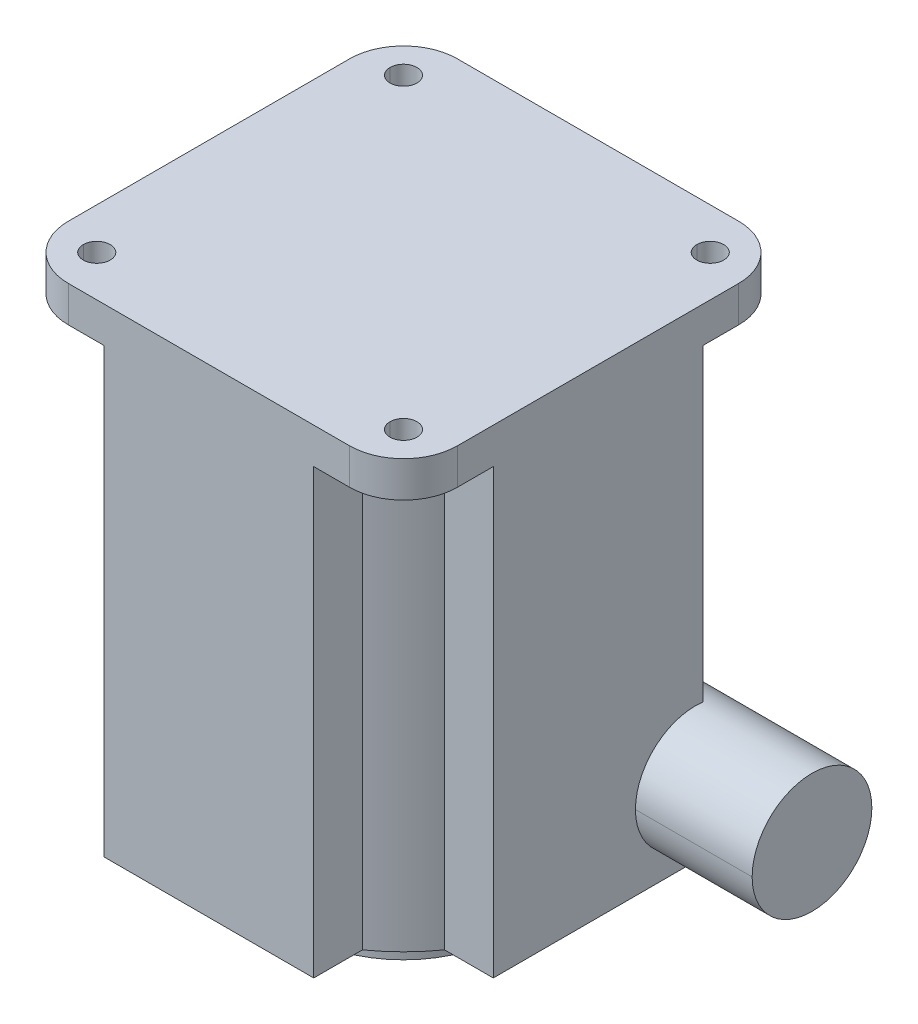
ISO-10303-21;
HEADER;
FILE_DESCRIPTION(('STEP AP214'),'2;1');
FILE_NAME('part.step','',(''),(''),'','','');
FILE_SCHEMA(('AUTOMOTIVE_DESIGN { 1 0 10303 214 1 1 1 1 }'));
ENDSEC;
DATA;
#1=APPLICATION_CONTEXT('core data for automotive mechanical design processes');
#2=APPLICATION_PROTOCOL_DEFINITION('international standard','automotive_design',2000,#1);
#3=PRODUCT_CONTEXT('',#1,'mechanical');
#4=PRODUCT('Part','Part','',(#3));
#5=PRODUCT_RELATED_PRODUCT_CATEGORY('part','',(#4));
#6=PRODUCT_DEFINITION_FORMATION('','',#4);
#7=PRODUCT_DEFINITION_CONTEXT('part definition',#1,'design');
#8=PRODUCT_DEFINITION('design','',#6,#7);
#9=PRODUCT_DEFINITION_SHAPE('','',#8);
#10=(LENGTH_UNIT() NAMED_UNIT(*) SI_UNIT(.MILLI.,.METRE.));
#11=(NAMED_UNIT(*) PLANE_ANGLE_UNIT() SI_UNIT($,.RADIAN.));
#12=(NAMED_UNIT(*) SI_UNIT($,.STERADIAN.) SOLID_ANGLE_UNIT());
#13=UNCERTAINTY_MEASURE_WITH_UNIT(LENGTH_MEASURE(1.E-05),#10,'distance_accuracy_value','');
#14=(GEOMETRIC_REPRESENTATION_CONTEXT(3) GLOBAL_UNCERTAINTY_ASSIGNED_CONTEXT((#13)) GLOBAL_UNIT_ASSIGNED_CONTEXT((#10,
#11,#12)) REPRESENTATION_CONTEXT('',''));
#15=CARTESIAN_POINT('',(0.,0.,0.));
#16=DIRECTION('',(0.,0.,1.));
#17=DIRECTION('',(1.,0.,0.));
#18=AXIS2_PLACEMENT_3D('',#15,#16,#17);
#19=CARTESIAN_POINT('',(110.,320.,1625.));
#20=DIRECTION('',(0.,-1.,0.));
#21=DIRECTION('',(1.,0.,0.));
#22=AXIS2_PLACEMENT_3D('',#19,#20,#21);
#23=PLANE('',#22);
#24=CARTESIAN_POINT('',(110.,320.,1625.));
#25=DIRECTION('',(0.,-1.,0.));
#26=DIRECTION('',(1.,0.,0.));
#27=AXIS2_PLACEMENT_3D('',#24,#25,#26);
#28=CIRCLE('',#27,35.);
#29=CARTESIAN_POINT('',(145.,320.,1625.));
#30=VERTEX_POINT('',#29);
#31=CARTESIAN_POINT('',(75.,320.,1625.));
#32=VERTEX_POINT('',#31);
#33=EDGE_CURVE('E21',#30,#32,#28,.T.);
#34=ORIENTED_EDGE('',*,*,#33,.T.);
#35=EDGE_CURVE('E269',#32,#30,#28,.T.);
#36=ORIENTED_EDGE('',*,*,#35,.T.);
#37=EDGE_LOOP('',(#34,#36));
#38=FACE_BOUND('',#37,.T.);
#39=ADVANCED_FACE('F17',(#38),#23,.T.);
#40=CARTESIAN_POINT('',(214.,500.,1625.));
#41=DIRECTION('',(1.,0.,0.));
#42=DIRECTION('',(0.,0.,1.));
#43=AXIS2_PLACEMENT_3D('',#40,#41,#42);
#44=PLANE('',#43);
#45=CARTESIAN_POINT('',(214.,365.,1592.5));
#46=DIRECTION('',(1.,0.,0.));
#47=DIRECTION('',(0.,1.,0.));
#48=AXIS2_PLACEMENT_3D('',#45,#46,#47);
#49=CIRCLE('',#48,20.);
#50=CARTESIAN_POINT('',(214.,365.,1612.5));
#51=VERTEX_POINT('',#50);
#52=CARTESIAN_POINT('',(214.,365.,1572.5));
#53=VERTEX_POINT('',#52);
#54=EDGE_CURVE('E286',#51,#53,#49,.T.);
#55=ORIENTED_EDGE('',*,*,#54,.T.);
#56=EDGE_CURVE('E281',#53,#51,#49,.T.);
#57=ORIENTED_EDGE('',*,*,#56,.T.);
#58=EDGE_LOOP('',(#55,#57));
#59=FACE_BOUND('',#58,.T.);
#60=ADVANCED_FACE('F1448',(#59),#44,.T.);
#61=CARTESIAN_POINT('',(110.,330.,1625.));
#62=DIRECTION('',(0.,-1.,0.));
#63=DIRECTION('',(1.,0.,0.));
#64=AXIS2_PLACEMENT_3D('',#61,#62,#63);
#65=CYLINDRICAL_SURFACE('',#64,35.);
#66=DIRECTION('',(0.,-1.,0.));
#67=VECTOR('',#66,1.);
#68=CARTESIAN_POINT('',(75.,330.,1625.));
#69=LINE('',#68,#67);
#70=CARTESIAN_POINT('',(75.,340.,1625.));
#71=VERTEX_POINT('',#70);
#72=EDGE_CURVE('E272',#32,#71,#69,.F.);
#73=ORIENTED_EDGE('',*,*,#72,.T.);
#74=CARTESIAN_POINT('',(110.,340.,1625.));
#75=DIRECTION('',(0.,-1.,0.));
#76=DIRECTION('',(1.,0.,0.));
#77=AXIS2_PLACEMENT_3D('',#74,#75,#76);
#78=CIRCLE('',#77,35.);
#79=CARTESIAN_POINT('',(145.,340.,1625.));
#80=VERTEX_POINT('',#79);
#81=EDGE_CURVE('E280',#71,#80,#78,.T.);
#82=ORIENTED_EDGE('',*,*,#81,.T.);
#83=DIRECTION('',(0.,-1.,0.));
#84=VECTOR('',#83,1.);
#85=CARTESIAN_POINT('',(145.,330.,1625.));
#86=LINE('',#85,#84);
#87=EDGE_CURVE('E284',#80,#30,#86,.T.);
#88=ORIENTED_EDGE('',*,*,#87,.T.);
#89=ORIENTED_EDGE('',*,*,#35,.F.);
#90=EDGE_LOOP('',(#73,#82,#88,#89));
#91=FACE_BOUND('',#90,.T.);
#92=ADVANCED_FACE('F283',(#91),#65,.T.);
#93=ORIENTED_EDGE('',*,*,#87,.F.);
#94=EDGE_CURVE('E275',#80,#71,#78,.T.);
#95=ORIENTED_EDGE('',*,*,#94,.T.);
#96=ORIENTED_EDGE('',*,*,#72,.F.);
#97=ORIENTED_EDGE('',*,*,#33,.F.);
#98=EDGE_LOOP('',(#93,#95,#96,#97));
#99=FACE_BOUND('',#98,.T.);
#100=ADVANCED_FACE('F273',(#99),#65,.T.);
#101=CARTESIAN_POINT('',(110.,420.,1625.));
#102=DIRECTION('',(0.,-1.,0.));
#103=DIRECTION('',(1.,0.,0.));
#104=AXIS2_PLACEMENT_3D('',#101,#102,#103);
#105=CYLINDRICAL_SURFACE('',#104,60.);
#106=DIRECTION('',(0.,1.,0.));
#107=VECTOR('',#106,1.);
#108=CARTESIAN_POINT('',(158.733971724,420.,1590.));
#109=LINE('',#108,#107);
#110=CARTESIAN_POINT('',(158.733971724,340.,1590.));
#111=VERTEX_POINT('',#110);
#112=CARTESIAN_POINT('',(158.733971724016,345.156865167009,1590.));
#113=VERTEX_POINT('',#112);
#114=EDGE_CURVE('E352',#111,#113,#109,.T.);
#115=ORIENTED_EDGE('',*,*,#114,.F.);
#116=CARTESIAN_POINT('',(110.,340.,1625.));
#117=DIRECTION('',(0.,-1.,0.));
#118=DIRECTION('',(1.,0.,0.));
#119=AXIS2_PLACEMENT_3D('',#116,#117,#118);
#120=CIRCLE('',#119,60.);
#121=CARTESIAN_POINT('',(145.,340.,1576.266028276));
#122=VERTEX_POINT('',#121);
#123=EDGE_CURVE('E310',#122,#111,#120,.T.);
#124=ORIENTED_EDGE('',*,*,#123,.F.);
#125=DIRECTION('',(0.,1.,0.));
#126=VECTOR('',#125,1.);
#127=CARTESIAN_POINT('',(145.,346.659234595,1576.266028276));
#128=LINE('',#127,#126);
#129=CARTESIAN_POINT('',(145.000000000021,353.318469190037,1576.266028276));
#130=VERTEX_POINT('',#129);
#131=EDGE_CURVE('E305',#122,#130,#128,.T.);
#132=ORIENTED_EDGE('',*,*,#131,.T.);
#133=CARTESIAN_POINT('',(145.000000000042,353.318469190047,1576.26602827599));
#134=CARTESIAN_POINT('',(145.270109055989,353.048945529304,1576.46000383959));
#135=CARTESIAN_POINT('',(145.542909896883,352.786037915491,1576.6593410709));
#136=CARTESIAN_POINT('',(146.092681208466,352.27307817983,1577.06842987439));
#137=CARTESIAN_POINT('',(146.369651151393,352.023024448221,1577.27818013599));
#138=CARTESIAN_POINT('',(146.926472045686,351.535453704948,1577.70772446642));
#139=CARTESIAN_POINT('',(147.206321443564,351.297930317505,1577.92751331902));
#140=CARTESIAN_POINT('',(147.768082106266,350.835051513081,1578.37702888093));
#141=CARTESIAN_POINT('',(148.049993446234,350.609696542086,1578.60675595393));
#142=CARTESIAN_POINT('',(148.884515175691,349.961763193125,1579.29979341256));
#143=CARTESIAN_POINT('',(149.438892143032,349.556052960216,1579.77693426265));
#144=CARTESIAN_POINT('',(150.546998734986,348.790566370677,1580.76772905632));
#145=CARTESIAN_POINT('',(151.100728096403,348.430804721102,1581.2813946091));
#146=CARTESIAN_POINT('',(152.263136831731,347.722073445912,1582.40248290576));
#147=CARTESIAN_POINT('',(152.871207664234,347.378580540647,1583.01401696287));
#148=CARTESIAN_POINT('',(154.074945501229,346.753891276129,1584.27947513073));
#149=CARTESIAN_POINT('',(154.670616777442,346.472673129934,1584.93338431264));
#150=CARTESIAN_POINT('',(155.558218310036,346.098308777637,1585.95311504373));
#151=CARTESIAN_POINT('',(155.856820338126,345.980260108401,1586.30417939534));
#152=CARTESIAN_POINT('',(156.448581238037,345.762789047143,1587.01653500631));
#153=CARTESIAN_POINT('',(156.741740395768,345.663365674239,1587.37782572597));
#154=CARTESIAN_POINT('',(157.322216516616,345.483960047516,1588.11061805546));
#155=CARTESIAN_POINT('',(157.609525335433,345.404003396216,1588.48213240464));
#156=CARTESIAN_POINT('',(158.17718247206,345.264706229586,1589.23435213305));
#157=CARTESIAN_POINT('',(158.4575292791,345.205370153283,1589.61505947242));
#158=CARTESIAN_POINT('',(158.733971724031,345.156865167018,1590.));
#159=B_SPLINE_CURVE_WITH_KNOTS('',3,(#133,#134,#135,#136,#137,#138,#139,#140,#141,#142,#143,
#144,#145,#146,#147,#148,#149,#150,#151,#152,#153,#154,#155,#156,#157,#158),.UNSPECIFIED.,.F.,
.F.,(4,2,2,2,2,2,2,2,2,2,2,2,4),(0.,1.28400645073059,2.56785170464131,3.85103727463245,
5.13426984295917,7.64126568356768,10.1490619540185,12.9309396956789,15.7118426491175,
17.1386939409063,18.5654700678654,19.994112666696,21.4230626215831),.UNSPECIFIED.);
#160=EDGE_CURVE('E309',#130,#113,#159,.T.);
#161=ORIENTED_EDGE('',*,*,#160,.T.);
#162=EDGE_LOOP('',(#115,#124,#132,#161));
#163=FACE_BOUND('',#162,.T.);
#164=ADVANCED_FACE('F334',(#163),#105,.T.);
#165=CARTESIAN_POINT('',(61.2660282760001,340.,1590.));
#166=VERTEX_POINT('',#165);
#167=CARTESIAN_POINT('',(75.,340.,1576.266028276));
#168=VERTEX_POINT('',#167);
#169=EDGE_CURVE('E319',#166,#168,#120,.T.);
#170=ORIENTED_EDGE('',*,*,#169,.F.);
#171=DIRECTION('',(0.,1.,0.));
#172=VECTOR('',#171,1.);
#173=CARTESIAN_POINT('',(61.2660282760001,414.,1590.));
#174=LINE('',#173,#172);
#175=CARTESIAN_POINT('',(61.2660282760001,488.,1590.));
#176=VERTEX_POINT('',#175);
#177=EDGE_CURVE('E320',#166,#176,#174,.T.);
#178=ORIENTED_EDGE('',*,*,#177,.T.);
#179=CARTESIAN_POINT('',(110.,488.,1625.));
#180=DIRECTION('',(0.,-1.,0.));
#181=DIRECTION('',(1.,0.,0.));
#182=AXIS2_PLACEMENT_3D('',#179,#180,#181);
#183=CIRCLE('',#182,60.);
#184=CARTESIAN_POINT('',(75.,488.,1576.266028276));
#185=VERTEX_POINT('',#184);
#186=EDGE_CURVE('E362',#176,#185,#183,.T.);
#187=ORIENTED_EDGE('',*,*,#186,.T.);
#188=DIRECTION('',(0.,1.,0.));
#189=VECTOR('',#188,1.);
#190=CARTESIAN_POINT('',(75.,414.,1576.266028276));
#191=LINE('',#190,#189);
#192=EDGE_CURVE('E359',#168,#185,#191,.T.);
#193=ORIENTED_EDGE('',*,*,#192,.F.);
#194=EDGE_LOOP('',(#170,#178,#187,#193));
#195=FACE_BOUND('',#194,.T.);
#196=ADVANCED_FACE('F332',(#195),#105,.T.);
#197=DIRECTION('',(0.,1.,0.));
#198=VECTOR('',#197,1.);
#199=CARTESIAN_POINT('',(145.,432.340765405,1576.266028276));
#200=LINE('',#199,#198);
#201=CARTESIAN_POINT('',(145.000000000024,376.681530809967,1576.266028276));
#202=VERTEX_POINT('',#201);
#203=CARTESIAN_POINT('',(145.,488.,1576.266028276));
#204=VERTEX_POINT('',#203);
#205=EDGE_CURVE('E356',#202,#204,#200,.T.);
#206=ORIENTED_EDGE('',*,*,#205,.T.);
#207=CARTESIAN_POINT('',(158.733971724,488.,1590.));
#208=VERTEX_POINT('',#207);
#209=EDGE_CURVE('E358',#204,#208,#183,.T.);
#210=ORIENTED_EDGE('',*,*,#209,.T.);
#211=CARTESIAN_POINT('',(158.733971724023,384.843134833,1590.));
#212=VERTEX_POINT('',#211);
#213=EDGE_CURVE('E349',#212,#208,#109,.T.);
#214=ORIENTED_EDGE('',*,*,#213,.F.);
#215=CARTESIAN_POINT('',(145.000000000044,376.681530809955,1576.266028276));
#216=CARTESIAN_POINT('',(145.270109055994,376.9510544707,1576.4600038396));
#217=CARTESIAN_POINT('',(145.542909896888,377.213962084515,1576.65934107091));
#218=CARTESIAN_POINT('',(146.092681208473,377.726921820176,1577.06842987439));
#219=CARTESIAN_POINT('',(146.369651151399,377.976975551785,1577.27818013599));
#220=CARTESIAN_POINT('',(146.926472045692,378.464546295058,1577.70772446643));
#221=CARTESIAN_POINT('',(147.20632144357,378.7020696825,1577.92751331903));
#222=CARTESIAN_POINT('',(147.768082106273,379.164948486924,1578.37702888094));
#223=CARTESIAN_POINT('',(148.04999344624,379.390303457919,1578.60675595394));
#224=CARTESIAN_POINT('',(148.884515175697,380.03823680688,1579.29979341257));
#225=CARTESIAN_POINT('',(149.438892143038,380.443947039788,1579.77693426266));
#226=CARTESIAN_POINT('',(150.546998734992,381.209433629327,1580.76772905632));
#227=CARTESIAN_POINT('',(151.10072809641,381.569195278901,1581.2813946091));
#228=CARTESIAN_POINT('',(152.263136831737,382.277926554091,1582.40248290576));
#229=CARTESIAN_POINT('',(152.87120766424,382.621419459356,1583.01401696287));
#230=CARTESIAN_POINT('',(154.074945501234,383.246108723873,1584.27947513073));
#231=CARTESIAN_POINT('',(154.670616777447,383.527326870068,1584.93338431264));
#232=CARTESIAN_POINT('',(155.55821831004,383.901691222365,1585.95311504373));
#233=CARTESIAN_POINT('',(155.856820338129,384.019739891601,1586.30417939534));
#234=CARTESIAN_POINT('',(156.44858123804,384.237210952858,1587.01653500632));
#235=CARTESIAN_POINT('',(156.741740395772,384.336634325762,1587.37782572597));
#236=CARTESIAN_POINT('',(157.322216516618,384.516039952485,1588.11061805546));
#237=CARTESIAN_POINT('',(157.609525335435,384.595996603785,1588.48213240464));
#238=CARTESIAN_POINT('',(158.177182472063,384.735293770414,1589.23435213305));
#239=CARTESIAN_POINT('',(158.457529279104,384.794629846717,1589.61505947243));
#240=CARTESIAN_POINT('',(158.733971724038,384.843134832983,1590.));
#241=B_SPLINE_CURVE_WITH_KNOTS('',3,(#215,#216,#217,#218,#219,#220,#221,#222,#223,#224,#225,
#226,#227,#228,#229,#230,#231,#232,#233,#234,#235,#236,#237,#238,#239,#240),.UNSPECIFIED.,.F.,
.F.,(4,2,2,2,2,2,2,2,2,2,2,2,4),(0.,1.28400645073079,2.56785170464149,3.85103727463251,
5.13426984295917,7.64126568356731,10.1490619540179,12.9309396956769,15.7118426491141,
17.1386939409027,18.5654700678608,19.9941126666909,21.4230626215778),.UNSPECIFIED.);
#242=EDGE_CURVE('E339',#202,#212,#241,.T.);
#243=ORIENTED_EDGE('',*,*,#242,.F.);
#244=EDGE_LOOP('',(#206,#210,#214,#243));
#245=FACE_BOUND('',#244,.T.);
#246=ADVANCED_FACE('F326',(#245),#105,.T.);
#247=CARTESIAN_POINT('',(158.733971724,340.,1660.));
#248=VERTEX_POINT('',#247);
#249=CARTESIAN_POINT('',(145.,340.,1673.733971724));
#250=VERTEX_POINT('',#249);
#251=EDGE_CURVE('E348',#248,#250,#120,.T.);
#252=ORIENTED_EDGE('',*,*,#251,.F.);
#253=DIRECTION('',(0.,1.,0.));
#254=VECTOR('',#253,1.);
#255=CARTESIAN_POINT('',(158.733971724,414.,1660.));
#256=LINE('',#255,#254);
#257=CARTESIAN_POINT('',(158.733971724,488.,1660.));
#258=VERTEX_POINT('',#257);
#259=EDGE_CURVE('E350',#248,#258,#256,.T.);
#260=ORIENTED_EDGE('',*,*,#259,.T.);
#261=CARTESIAN_POINT('',(145.,488.,1673.733971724));
#262=VERTEX_POINT('',#261);
#263=EDGE_CURVE('E370',#258,#262,#183,.T.);
#264=ORIENTED_EDGE('',*,*,#263,.T.);
#265=DIRECTION('',(0.,1.,0.));
#266=VECTOR('',#265,1.);
#267=CARTESIAN_POINT('',(145.,420.,1673.733971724));
#268=LINE('',#267,#266);
#269=EDGE_CURVE('E380',#250,#262,#268,.T.);
#270=ORIENTED_EDGE('',*,*,#269,.F.);
#271=EDGE_LOOP('',(#252,#260,#264,#270));
#272=FACE_BOUND('',#271,.T.);
#273=ADVANCED_FACE('F331',(#272),#105,.T.);
#274=CARTESIAN_POINT('',(75.,488.,1673.733971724));
#275=VERTEX_POINT('',#274);
#276=CARTESIAN_POINT('',(61.2660282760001,488.,1660.));
#277=VERTEX_POINT('',#276);
#278=EDGE_CURVE('E381',#275,#277,#183,.T.);
#279=ORIENTED_EDGE('',*,*,#278,.T.);
#280=DIRECTION('',(0.,1.,0.));
#281=VECTOR('',#280,1.);
#282=CARTESIAN_POINT('',(61.2660282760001,420.,1660.));
#283=LINE('',#282,#281);
#284=CARTESIAN_POINT('',(61.2660282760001,340.,1660.));
#285=VERTEX_POINT('',#284);
#286=EDGE_CURVE('E392',#285,#277,#283,.T.);
#287=ORIENTED_EDGE('',*,*,#286,.F.);
#288=CARTESIAN_POINT('',(75.,340.,1673.733971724));
#289=VERTEX_POINT('',#288);
#290=EDGE_CURVE('E399',#289,#285,#120,.T.);
#291=ORIENTED_EDGE('',*,*,#290,.F.);
#292=DIRECTION('',(0.,1.,0.));
#293=VECTOR('',#292,1.);
#294=CARTESIAN_POINT('',(75.,414.,1673.733971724));
#295=LINE('',#294,#293);
#296=EDGE_CURVE('E501',#289,#275,#295,.T.);
#297=ORIENTED_EDGE('',*,*,#296,.T.);
#298=EDGE_LOOP('',(#279,#287,#291,#297));
#299=FACE_BOUND('',#298,.T.);
#300=ADVANCED_FACE('F526',(#299),#105,.T.);
#301=CARTESIAN_POINT('',(75.,500.,1560.));
#302=DIRECTION('',(1.,0.,0.));
#303=DIRECTION('',(0.,0.,1.));
#304=AXIS2_PLACEMENT_3D('',#301,#302,#303);
#305=PLANE('',#304);
#306=ORIENTED_EDGE('',*,*,#192,.T.);
#307=DIRECTION('',(0.,0.,1.));
#308=VECTOR('',#307,1.);
#309=CARTESIAN_POINT('',(75.,488.,1568.133014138));
#310=LINE('',#309,#308);
#311=CARTESIAN_POINT('',(75.,488.,1560.));
#312=VERTEX_POINT('',#311);
#313=EDGE_CURVE('E498',#312,#185,#310,.T.);
#314=ORIENTED_EDGE('',*,*,#313,.F.);
#315=DIRECTION('',(0.,-1.,0.));
#316=VECTOR('',#315,1.);
#317=CARTESIAN_POINT('',(75.,414.,1560.));
#318=LINE('',#317,#316);
#319=CARTESIAN_POINT('',(75.,340.,1560.));
#320=VERTEX_POINT('',#319);
#321=EDGE_CURVE('E495',#312,#320,#318,.T.);
#322=ORIENTED_EDGE('',*,*,#321,.T.);
#323=DIRECTION('',(0.,0.,1.));
#324=VECTOR('',#323,1.);
#325=CARTESIAN_POINT('',(75.,340.,1568.133014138));
#326=LINE('',#325,#324);
#327=EDGE_CURVE('E492',#320,#168,#326,.T.);
#328=ORIENTED_EDGE('',*,*,#327,.T.);
#329=EDGE_LOOP('',(#306,#314,#322,#328));
#330=FACE_BOUND('',#329,.T.);
#331=ADVANCED_FACE('F336',(#330),#305,.F.);
#332=CARTESIAN_POINT('',(145.,500.,1610.));
#333=DIRECTION('',(-1.,0.,0.));
#334=DIRECTION('',(0.,0.,-1.));
#335=AXIS2_PLACEMENT_3D('',#332,#333,#334);
#336=PLANE('',#335);
#337=CARTESIAN_POINT('',(145.,365.,1592.5));
#338=DIRECTION('',(-1.,0.,0.));
#339=DIRECTION('',(0.,1.,0.));
#340=AXIS2_PLACEMENT_3D('',#337,#338,#339);
#341=CIRCLE('',#340,20.);
#342=CARTESIAN_POINT('',(145.,365.,1572.5));
#343=VERTEX_POINT('',#342);
#344=EDGE_CURVE('E491',#202,#343,#341,.T.);
#345=ORIENTED_EDGE('',*,*,#344,.T.);
#346=EDGE_CURVE('E487',#343,#130,#341,.T.);
#347=ORIENTED_EDGE('',*,*,#346,.T.);
#348=ORIENTED_EDGE('',*,*,#131,.F.);
#349=DIRECTION('',(0.,0.,-1.));
#350=VECTOR('',#349,1.);
#351=CARTESIAN_POINT('',(145.,340.,1568.133014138));
#352=LINE('',#351,#350);
#353=CARTESIAN_POINT('',(145.,340.,1560.));
#354=VERTEX_POINT('',#353);
#355=EDGE_CURVE('E484',#122,#354,#352,.T.);
#356=ORIENTED_EDGE('',*,*,#355,.T.);
#357=DIRECTION('',(0.,-1.,0.));
#358=VECTOR('',#357,1.);
#359=CARTESIAN_POINT('',(145.,414.,1560.));
#360=LINE('',#359,#358);
#361=CARTESIAN_POINT('',(145.,488.,1560.));
#362=VERTEX_POINT('',#361);
#363=EDGE_CURVE('E480',#362,#354,#360,.T.);
#364=ORIENTED_EDGE('',*,*,#363,.F.);
#365=DIRECTION('',(0.,0.,1.));
#366=VECTOR('',#365,1.);
#367=CARTESIAN_POINT('',(145.,488.,1568.133014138));
#368=LINE('',#367,#366);
#369=EDGE_CURVE('E477',#362,#204,#368,.T.);
#370=ORIENTED_EDGE('',*,*,#369,.T.);
#371=ORIENTED_EDGE('',*,*,#205,.F.);
#372=EDGE_LOOP('',(#345,#347,#348,#356,#364,#370,#371));
#373=FACE_BOUND('',#372,.T.);
#374=ADVANCED_FACE('F685',(#373),#336,.F.);
#375=CARTESIAN_POINT('',(162.,365.,1592.5));
#376=DIRECTION('',(1.,0.,0.));
#377=DIRECTION('',(0.,0.,1.));
#378=AXIS2_PLACEMENT_3D('',#375,#376,#377);
#379=CYLINDRICAL_SURFACE('',#378,20.);
#380=DIRECTION('',(1.,0.,0.));
#381=VECTOR('',#380,1.);
#382=CARTESIAN_POINT('',(162.,365.,1612.5));
#383=LINE('',#382,#381);
#384=CARTESIAN_POINT('',(175.,365.,1612.5));
#385=VERTEX_POINT('',#384);
#386=EDGE_CURVE('E473',#385,#51,#383,.T.);
#387=ORIENTED_EDGE('',*,*,#386,.T.);
#388=ORIENTED_EDGE('',*,*,#56,.F.);
#389=DIRECTION('',(1.,0.,0.));
#390=VECTOR('',#389,1.);
#391=CARTESIAN_POINT('',(162.,365.,1572.5));
#392=LINE('',#391,#390);
#393=EDGE_CURVE('E469',#53,#343,#392,.F.);
#394=ORIENTED_EDGE('',*,*,#393,.T.);
#395=ORIENTED_EDGE('',*,*,#344,.F.);
#396=ORIENTED_EDGE('',*,*,#242,.T.);
#397=DIRECTION('',(-1.,0.,0.));
#398=VECTOR('',#397,1.);
#399=CARTESIAN_POINT('',(162.,384.843134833,1590.));
#400=LINE('',#399,#398);
#401=CARTESIAN_POINT('',(175.,384.843134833,1590.));
#402=VERTEX_POINT('',#401);
#403=EDGE_CURVE('E466',#402,#212,#400,.T.);
#404=ORIENTED_EDGE('',*,*,#403,.F.);
#405=CARTESIAN_POINT('',(175.,365.,1592.5));
#406=DIRECTION('',(1.,0.,0.));
#407=DIRECTION('',(0.,1.,0.));
#408=AXIS2_PLACEMENT_3D('',#405,#406,#407);
#409=CIRCLE('',#408,20.);
#410=EDGE_CURVE('E463',#402,#385,#409,.T.);
#411=ORIENTED_EDGE('',*,*,#410,.T.);
#412=EDGE_LOOP('',(#387,#388,#394,#395,#396,#404,#411));
#413=FACE_BOUND('',#412,.T.);
#414=ADVANCED_FACE('F322',(#413),#379,.T.);
#415=ORIENTED_EDGE('',*,*,#393,.F.);
#416=ORIENTED_EDGE('',*,*,#54,.F.);
#417=ORIENTED_EDGE('',*,*,#386,.F.);
#418=CARTESIAN_POINT('',(175.,345.156865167,1590.));
#419=VERTEX_POINT('',#418);
#420=EDGE_CURVE('E462',#385,#419,#409,.T.);
#421=ORIENTED_EDGE('',*,*,#420,.T.);
#422=DIRECTION('',(-1.,0.,0.));
#423=VECTOR('',#422,1.);
#424=CARTESIAN_POINT('',(162.,345.156865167,1590.));
#425=LINE('',#424,#423);
#426=EDGE_CURVE('E458',#419,#113,#425,.T.);
#427=ORIENTED_EDGE('',*,*,#426,.T.);
#428=ORIENTED_EDGE('',*,*,#160,.F.);
#429=ORIENTED_EDGE('',*,*,#346,.F.);
#430=EDGE_LOOP('',(#415,#416,#417,#421,#427,#428,#429));
#431=FACE_BOUND('',#430,.T.);
#432=ADVANCED_FACE('F732',(#431),#379,.T.);
#433=CARTESIAN_POINT('',(175.,500.,1590.));
#434=DIRECTION('',(0.,0.,1.));
#435=DIRECTION('',(-1.,0.,0.));
#436=AXIS2_PLACEMENT_3D('',#433,#434,#435);
#437=PLANE('',#436);
#438=ORIENTED_EDGE('',*,*,#426,.F.);
#439=DIRECTION('',(0.,-1.,0.));
#440=VECTOR('',#439,1.);
#441=CARTESIAN_POINT('',(175.,342.578432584,1590.));
#442=LINE('',#441,#440);
#443=CARTESIAN_POINT('',(175.,340.,1590.));
#444=VERTEX_POINT('',#443);
#445=EDGE_CURVE('E455',#419,#444,#442,.T.);
#446=ORIENTED_EDGE('',*,*,#445,.T.);
#447=DIRECTION('',(-1.,0.,0.));
#448=VECTOR('',#447,1.);
#449=CARTESIAN_POINT('',(166.866985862,340.,1590.));
#450=LINE('',#449,#448);
#451=EDGE_CURVE('E452',#444,#111,#450,.T.);
#452=ORIENTED_EDGE('',*,*,#451,.T.);
#453=ORIENTED_EDGE('',*,*,#114,.T.);
#454=EDGE_LOOP('',(#438,#446,#452,#453));
#455=FACE_BOUND('',#454,.T.);
#456=ADVANCED_FACE('F756',(#455),#437,.F.);
#457=CARTESIAN_POINT('',(125.,500.,1660.));
#458=DIRECTION('',(0.,0.,-1.));
#459=DIRECTION('',(1.,0.,0.));
#460=AXIS2_PLACEMENT_3D('',#457,#458,#459);
#461=PLANE('',#460);
#462=DIRECTION('',(-1.,0.,0.));
#463=VECTOR('',#462,1.);
#464=CARTESIAN_POINT('',(166.866985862,488.,1660.));
#465=LINE('',#464,#463);
#466=CARTESIAN_POINT('',(175.,488.,1660.));
#467=VERTEX_POINT('',#466);
#468=EDGE_CURVE('E449',#467,#258,#465,.T.);
#469=ORIENTED_EDGE('',*,*,#468,.T.);
#470=ORIENTED_EDGE('',*,*,#259,.F.);
#471=DIRECTION('',(1.,0.,0.));
#472=VECTOR('',#471,1.);
#473=CARTESIAN_POINT('',(166.866985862,340.,1660.));
#474=LINE('',#473,#472);
#475=CARTESIAN_POINT('',(175.,340.,1660.));
#476=VERTEX_POINT('',#475);
#477=EDGE_CURVE('E446',#248,#476,#474,.T.);
#478=ORIENTED_EDGE('',*,*,#477,.T.);
#479=DIRECTION('',(0.,-1.,0.));
#480=VECTOR('',#479,1.);
#481=CARTESIAN_POINT('',(175.,414.,1660.));
#482=LINE('',#481,#480);
#483=EDGE_CURVE('E442',#467,#476,#482,.T.);
#484=ORIENTED_EDGE('',*,*,#483,.F.);
#485=EDGE_LOOP('',(#469,#470,#478,#484));
#486=FACE_BOUND('',#485,.T.);
#487=ADVANCED_FACE('F773',(#486),#461,.F.);
#488=ORIENTED_EDGE('',*,*,#403,.T.);
#489=ORIENTED_EDGE('',*,*,#213,.T.);
#490=DIRECTION('',(-1.,0.,0.));
#491=VECTOR('',#490,1.);
#492=CARTESIAN_POINT('',(166.866985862,488.,1590.));
#493=LINE('',#492,#491);
#494=CARTESIAN_POINT('',(175.,488.,1590.));
#495=VERTEX_POINT('',#494);
#496=EDGE_CURVE('E436',#495,#208,#493,.T.);
#497=ORIENTED_EDGE('',*,*,#496,.F.);
#498=DIRECTION('',(0.,-1.,0.));
#499=VECTOR('',#498,1.);
#500=CARTESIAN_POINT('',(175.,436.4215674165,1590.));
#501=LINE('',#500,#499);
#502=EDGE_CURVE('E427',#495,#402,#501,.T.);
#503=ORIENTED_EDGE('',*,*,#502,.T.);
#504=EDGE_LOOP('',(#488,#489,#497,#503));
#505=FACE_BOUND('',#504,.T.);
#506=ADVANCED_FACE('F775',(#505),#437,.F.);
#507=CARTESIAN_POINT('',(145.,500.,1690.));
#508=DIRECTION('',(-1.,0.,0.));
#509=DIRECTION('',(0.,0.,-1.));
#510=AXIS2_PLACEMENT_3D('',#507,#508,#509);
#511=PLANE('',#510);
#512=ORIENTED_EDGE('',*,*,#269,.T.);
#513=DIRECTION('',(0.,0.,-1.));
#514=VECTOR('',#513,1.);
#515=CARTESIAN_POINT('',(145.,488.,1681.866985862));
#516=LINE('',#515,#514);
#517=CARTESIAN_POINT('',(145.,488.,1690.));
#518=VERTEX_POINT('',#517);
#519=EDGE_CURVE('E409',#518,#262,#516,.T.);
#520=ORIENTED_EDGE('',*,*,#519,.F.);
#521=DIRECTION('',(0.,-1.,0.));
#522=VECTOR('',#521,1.);
#523=CARTESIAN_POINT('',(145.,414.,1690.));
#524=LINE('',#523,#522);
#525=CARTESIAN_POINT('',(145.,340.,1690.));
#526=VERTEX_POINT('',#525);
#527=EDGE_CURVE('E426',#518,#526,#524,.T.);
#528=ORIENTED_EDGE('',*,*,#527,.T.);
#529=DIRECTION('',(0.,0.,-1.));
#530=VECTOR('',#529,1.);
#531=CARTESIAN_POINT('',(145.,340.,1681.866985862));
#532=LINE('',#531,#530);
#533=EDGE_CURVE('E411',#526,#250,#532,.T.);
#534=ORIENTED_EDGE('',*,*,#533,.T.);
#535=EDGE_LOOP('',(#512,#520,#528,#534));
#536=FACE_BOUND('',#535,.T.);
#537=ADVANCED_FACE('F406',(#536),#511,.F.);
#538=CARTESIAN_POINT('',(75.,500.,1640.));
#539=DIRECTION('',(1.,0.,0.));
#540=DIRECTION('',(0.,0.,1.));
#541=AXIS2_PLACEMENT_3D('',#538,#539,#540);
#542=PLANE('',#541);
#543=DIRECTION('',(0.,0.,-1.));
#544=VECTOR('',#543,1.);
#545=CARTESIAN_POINT('',(75.,488.,1681.866985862));
#546=LINE('',#545,#544);
#547=CARTESIAN_POINT('',(75.,488.,1690.));
#548=VERTEX_POINT('',#547);
#549=EDGE_CURVE('E554',#548,#275,#546,.T.);
#550=ORIENTED_EDGE('',*,*,#549,.T.);
#551=ORIENTED_EDGE('',*,*,#296,.F.);
#552=DIRECTION('',(0.,0.,1.));
#553=VECTOR('',#552,1.);
#554=CARTESIAN_POINT('',(75.,340.,1681.866985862));
#555=LINE('',#554,#553);
#556=CARTESIAN_POINT('',(75.,340.,1690.));
#557=VERTEX_POINT('',#556);
#558=EDGE_CURVE('E524',#289,#557,#555,.T.);
#559=ORIENTED_EDGE('',*,*,#558,.T.);
#560=DIRECTION('',(0.,-1.,0.));
#561=VECTOR('',#560,1.);
#562=CARTESIAN_POINT('',(75.,414.,1690.));
#563=LINE('',#562,#561);
#564=EDGE_CURVE('E549',#548,#557,#563,.T.);
#565=ORIENTED_EDGE('',*,*,#564,.F.);
#566=EDGE_LOOP('',(#550,#551,#559,#565));
#567=FACE_BOUND('',#566,.T.);
#568=ADVANCED_FACE('F828',(#567),#542,.F.);
#569=CARTESIAN_POINT('',(45.,500.,1660.));
#570=DIRECTION('',(0.,0.,-1.));
#571=DIRECTION('',(1.,0.,0.));
#572=AXIS2_PLACEMENT_3D('',#569,#570,#571);
#573=PLANE('',#572);
#574=ORIENTED_EDGE('',*,*,#286,.T.);
#575=DIRECTION('',(1.,0.,0.));
#576=VECTOR('',#575,1.);
#577=CARTESIAN_POINT('',(53.1330141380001,488.,1660.));
#578=LINE('',#577,#576);
#579=CARTESIAN_POINT('',(45.,488.,1660.));
#580=VERTEX_POINT('',#579);
#581=EDGE_CURVE('E530',#580,#277,#578,.T.);
#582=ORIENTED_EDGE('',*,*,#581,.F.);
#583=DIRECTION('',(0.,-1.,0.));
#584=VECTOR('',#583,1.);
#585=CARTESIAN_POINT('',(45.,414.,1660.));
#586=LINE('',#585,#584);
#587=CARTESIAN_POINT('',(45.,340.,1660.));
#588=VERTEX_POINT('',#587);
#589=EDGE_CURVE('E532',#580,#588,#586,.T.);
#590=ORIENTED_EDGE('',*,*,#589,.T.);
#591=DIRECTION('',(1.,0.,0.));
#592=VECTOR('',#591,1.);
#593=CARTESIAN_POINT('',(53.1330141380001,340.,1660.));
#594=LINE('',#593,#592);
#595=EDGE_CURVE('E521',#588,#285,#594,.T.);
#596=ORIENTED_EDGE('',*,*,#595,.T.);
#597=EDGE_LOOP('',(#574,#582,#590,#596));
#598=FACE_BOUND('',#597,.T.);
#599=ADVANCED_FACE('F528',(#598),#573,.F.);
#600=CARTESIAN_POINT('',(110.,340.,1625.));
#601=DIRECTION('',(0.,-1.,0.));
#602=DIRECTION('',(1.,0.,0.));
#603=AXIS2_PLACEMENT_3D('',#600,#601,#602);
#604=PLANE('',#603);
#605=ORIENTED_EDGE('',*,*,#327,.F.);
#606=DIRECTION('',(1.,0.,0.));
#607=VECTOR('',#606,1.);
#608=CARTESIAN_POINT('',(110.,340.,1560.));
#609=LINE('',#608,#607);
#610=EDGE_CURVE('E534',#320,#354,#609,.T.);
#611=ORIENTED_EDGE('',*,*,#610,.T.);
#612=ORIENTED_EDGE('',*,*,#355,.F.);
#613=ORIENTED_EDGE('',*,*,#123,.T.);
#614=ORIENTED_EDGE('',*,*,#451,.F.);
#615=DIRECTION('',(0.,0.,1.));
#616=VECTOR('',#615,1.);
#617=CARTESIAN_POINT('',(175.,340.,1625.));
#618=LINE('',#617,#616);
#619=EDGE_CURVE('E541',#444,#476,#618,.T.);
#620=ORIENTED_EDGE('',*,*,#619,.T.);
#621=ORIENTED_EDGE('',*,*,#477,.F.);
#622=ORIENTED_EDGE('',*,*,#251,.T.);
#623=ORIENTED_EDGE('',*,*,#533,.F.);
#624=DIRECTION('',(-1.,0.,0.));
#625=VECTOR('',#624,1.);
#626=CARTESIAN_POINT('',(110.,340.,1690.));
#627=LINE('',#626,#625);
#628=EDGE_CURVE('E842',#526,#557,#627,.T.);
#629=ORIENTED_EDGE('',*,*,#628,.T.);
#630=ORIENTED_EDGE('',*,*,#558,.F.);
#631=ORIENTED_EDGE('',*,*,#290,.T.);
#632=ORIENTED_EDGE('',*,*,#595,.F.);
#633=DIRECTION('',(0.,0.,-1.));
#634=VECTOR('',#633,1.);
#635=CARTESIAN_POINT('',(45.,340.,1625.));
#636=LINE('',#635,#634);
#637=CARTESIAN_POINT('',(45.,340.,1590.));
#638=VERTEX_POINT('',#637);
#639=EDGE_CURVE('E851',#588,#638,#636,.T.);
#640=ORIENTED_EDGE('',*,*,#639,.T.);
#641=DIRECTION('',(-1.,0.,0.));
#642=VECTOR('',#641,1.);
#643=CARTESIAN_POINT('',(53.1330141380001,340.,1590.));
#644=LINE('',#643,#642);
#645=EDGE_CURVE('E847',#166,#638,#644,.T.);
#646=ORIENTED_EDGE('',*,*,#645,.F.);
#647=ORIENTED_EDGE('',*,*,#169,.T.);
#648=EDGE_LOOP('',(#605,#611,#612,#613,#614,#620,#621,#622,#623,#629,#630,#631,#632,#640,#646,#647));
#649=FACE_BOUND('',#648,.T.);
#650=ORIENTED_EDGE('',*,*,#94,.F.);
#651=ORIENTED_EDGE('',*,*,#81,.F.);
#652=EDGE_LOOP('',(#650,#651));
#653=FACE_BOUND('',#652,.T.);
#654=ADVANCED_FACE('F518',(#649,#653),#604,.T.);
#655=CARTESIAN_POINT('',(95.,500.,1590.));
#656=DIRECTION('',(0.,0.,1.));
#657=DIRECTION('',(-1.,0.,0.));
#658=AXIS2_PLACEMENT_3D('',#655,#656,#657);
#659=PLANE('',#658);
#660=DIRECTION('',(1.,0.,0.));
#661=VECTOR('',#660,1.);
#662=CARTESIAN_POINT('',(53.1330141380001,488.,1590.));
#663=LINE('',#662,#661);
#664=CARTESIAN_POINT('',(45.,488.,1590.));
#665=VERTEX_POINT('',#664);
#666=EDGE_CURVE('E850',#665,#176,#663,.T.);
#667=ORIENTED_EDGE('',*,*,#666,.T.);
#668=ORIENTED_EDGE('',*,*,#177,.F.);
#669=ORIENTED_EDGE('',*,*,#645,.T.);
#670=DIRECTION('',(0.,-1.,0.));
#671=VECTOR('',#670,1.);
#672=CARTESIAN_POINT('',(45.,414.,1590.));
#673=LINE('',#672,#671);
#674=EDGE_CURVE('E1697',#665,#638,#673,.T.);
#675=ORIENTED_EDGE('',*,*,#674,.F.);
#676=EDGE_LOOP('',(#667,#668,#669,#675));
#677=FACE_BOUND('',#676,.T.);
#678=ADVANCED_FACE('F1287',(#677),#659,.F.);
#679=CARTESIAN_POINT('',(58.75,498.5,1573.75));
#680=DIRECTION('',(0.,-1.,0.));
#681=DIRECTION('',(1.,0.,0.));
#682=AXIS2_PLACEMENT_3D('',#679,#680,#681);
#683=CYLINDRICAL_SURFACE('',#682,4.5);
#684=DIRECTION('',(0.,1.,0.));
#685=VECTOR('',#684,1.);
#686=CARTESIAN_POINT('',(63.25,498.5,1573.75));
#687=LINE('',#686,#685);
#688=CARTESIAN_POINT('',(63.25,488.,1573.75));
#689=VERTEX_POINT('',#688);
#690=CARTESIAN_POINT('',(63.25,500.,1573.75));
#691=VERTEX_POINT('',#690);
#692=EDGE_CURVE('E1694',#689,#691,#687,.T.);
#693=ORIENTED_EDGE('',*,*,#692,.T.);
#694=CARTESIAN_POINT('',(58.75,500.,1573.75));
#695=DIRECTION('',(0.,-1.,0.));
#696=DIRECTION('',(1.,0.,0.));
#697=AXIS2_PLACEMENT_3D('',#694,#695,#696);
#698=CIRCLE('',#697,4.5);
#699=CARTESIAN_POINT('',(54.25,500.,1573.75));
#700=VERTEX_POINT('',#699);
#701=EDGE_CURVE('E1691',#700,#691,#698,.T.);
#702=ORIENTED_EDGE('',*,*,#701,.F.);
#703=DIRECTION('',(0.,1.,0.));
#704=VECTOR('',#703,1.);
#705=CARTESIAN_POINT('',(54.25,498.5,1573.75));
#706=LINE('',#705,#704);
#707=CARTESIAN_POINT('',(54.25,488.,1573.75));
#708=VERTEX_POINT('',#707);
#709=EDGE_CURVE('E861',#700,#708,#706,.F.);
#710=ORIENTED_EDGE('',*,*,#709,.T.);
#711=CARTESIAN_POINT('',(58.75,488.,1573.75));
#712=DIRECTION('',(0.,-1.,0.));
#713=DIRECTION('',(1.,0.,0.));
#714=AXIS2_PLACEMENT_3D('',#711,#712,#713);
#715=CIRCLE('',#714,4.5);
#716=EDGE_CURVE('E857',#708,#689,#715,.T.);
#717=ORIENTED_EDGE('',*,*,#716,.T.);
#718=EDGE_LOOP('',(#693,#702,#710,#717));
#719=FACE_BOUND('',#718,.T.);
#720=ADVANCED_FACE('F1274',(#719),#683,.F.);
#721=ORIENTED_EDGE('',*,*,#709,.F.);
#722=EDGE_CURVE('E860',#691,#700,#698,.T.);
#723=ORIENTED_EDGE('',*,*,#722,.F.);
#724=ORIENTED_EDGE('',*,*,#692,.F.);
#725=EDGE_CURVE('E863',#689,#708,#715,.T.);
#726=ORIENTED_EDGE('',*,*,#725,.T.);
#727=EDGE_LOOP('',(#721,#723,#724,#726));
#728=FACE_BOUND('',#727,.T.);
#729=ADVANCED_FACE('F1262',(#728),#683,.F.);
#730=CARTESIAN_POINT('',(110.,488.,1625.));
#731=DIRECTION('',(0.,-1.,0.));
#732=DIRECTION('',(1.,0.,0.));
#733=AXIS2_PLACEMENT_3D('',#730,#731,#732);
#734=PLANE('',#733);
#735=ORIENTED_EDGE('',*,*,#186,.F.);
#736=ORIENTED_EDGE('',*,*,#666,.F.);
#737=DIRECTION('',(0.,0.,-1.));
#738=VECTOR('',#737,1.);
#739=CARTESIAN_POINT('',(45.,488.,1584.));
#740=LINE('',#739,#738);
#741=CARTESIAN_POINT('',(45.,488.,1578.));
#742=VERTEX_POINT('',#741);
#743=EDGE_CURVE('E1658',#665,#742,#740,.T.);
#744=ORIENTED_EDGE('',*,*,#743,.T.);
#745=CARTESIAN_POINT('',(63.,488.,1578.));
#746=DIRECTION('',(0.,1.,0.));
#747=DIRECTION('',(1.,0.,0.));
#748=AXIS2_PLACEMENT_3D('',#745,#746,#747);
#749=CIRCLE('',#748,18.);
#750=CARTESIAN_POINT('',(63.,488.,1560.));
#751=VERTEX_POINT('',#750);
#752=EDGE_CURVE('E1654',#751,#742,#749,.T.);
#753=ORIENTED_EDGE('',*,*,#752,.F.);
#754=DIRECTION('',(1.,0.,0.));
#755=VECTOR('',#754,1.);
#756=CARTESIAN_POINT('',(69.,488.,1560.));
#757=LINE('',#756,#755);
#758=EDGE_CURVE('E1657',#751,#312,#757,.T.);
#759=ORIENTED_EDGE('',*,*,#758,.T.);
#760=ORIENTED_EDGE('',*,*,#313,.T.);
#761=EDGE_LOOP('',(#735,#736,#744,#753,#759,#760));
#762=FACE_BOUND('',#761,.T.);
#763=ORIENTED_EDGE('',*,*,#725,.F.);
#764=ORIENTED_EDGE('',*,*,#716,.F.);
#765=EDGE_LOOP('',(#763,#764));
#766=FACE_BOUND('',#765,.T.);
#767=ADVANCED_FACE('F903',(#762,#766),#734,.T.);
#768=CARTESIAN_POINT('',(161.25,498.5,1573.75));
#769=DIRECTION('',(0.,-1.,0.));
#770=DIRECTION('',(-1.,0.,0.));
#771=AXIS2_PLACEMENT_3D('',#768,#769,#770);
#772=CYLINDRICAL_SURFACE('',#771,4.5);
#773=DIRECTION('',(0.,1.,0.));
#774=VECTOR('',#773,1.);
#775=CARTESIAN_POINT('',(156.75,498.5,1573.75));
#776=LINE('',#775,#774);
#777=CARTESIAN_POINT('',(156.75,488.,1573.75));
#778=VERTEX_POINT('',#777);
#779=CARTESIAN_POINT('',(156.75,500.,1573.75));
#780=VERTEX_POINT('',#779);
#781=EDGE_CURVE('E1671',#778,#780,#776,.T.);
#782=ORIENTED_EDGE('',*,*,#781,.T.);
#783=CARTESIAN_POINT('',(161.25,500.,1573.75));
#784=DIRECTION('',(0.,-1.,0.));
#785=DIRECTION('',(1.,0.,0.));
#786=AXIS2_PLACEMENT_3D('',#783,#784,#785);
#787=CIRCLE('',#786,4.5);
#788=CARTESIAN_POINT('',(165.75,500.,1573.75));
#789=VERTEX_POINT('',#788);
#790=EDGE_CURVE('E872',#789,#780,#787,.T.);
#791=ORIENTED_EDGE('',*,*,#790,.F.);
#792=DIRECTION('',(0.,1.,0.));
#793=VECTOR('',#792,1.);
#794=CARTESIAN_POINT('',(165.75,498.5,1573.75));
#795=LINE('',#794,#793);
#796=CARTESIAN_POINT('',(165.75,488.,1573.75));
#797=VERTEX_POINT('',#796);
#798=EDGE_CURVE('E868',#789,#797,#795,.F.);
#799=ORIENTED_EDGE('',*,*,#798,.T.);
#800=CARTESIAN_POINT('',(161.25,488.,1573.75));
#801=DIRECTION('',(0.,-1.,0.));
#802=DIRECTION('',(1.,0.,0.));
#803=AXIS2_PLACEMENT_3D('',#800,#801,#802);
#804=CIRCLE('',#803,4.5);
#805=EDGE_CURVE('E871',#797,#778,#804,.T.);
#806=ORIENTED_EDGE('',*,*,#805,.T.);
#807=EDGE_LOOP('',(#782,#791,#799,#806));
#808=FACE_BOUND('',#807,.T.);
#809=ADVANCED_FACE('F1238',(#808),#772,.F.);
#810=ORIENTED_EDGE('',*,*,#798,.F.);
#811=EDGE_CURVE('E1581',#780,#789,#787,.T.);
#812=ORIENTED_EDGE('',*,*,#811,.F.);
#813=ORIENTED_EDGE('',*,*,#781,.F.);
#814=EDGE_CURVE('E1575',#778,#797,#804,.T.);
#815=ORIENTED_EDGE('',*,*,#814,.T.);
#816=EDGE_LOOP('',(#810,#812,#813,#815));
#817=FACE_BOUND('',#816,.T.);
#818=ADVANCED_FACE('F1226',(#817),#772,.F.);
#819=ORIENTED_EDGE('',*,*,#209,.F.);
#820=ORIENTED_EDGE('',*,*,#369,.F.);
#821=DIRECTION('',(1.,0.,0.));
#822=VECTOR('',#821,1.);
#823=CARTESIAN_POINT('',(151.,488.,1560.));
#824=LINE('',#823,#822);
#825=CARTESIAN_POINT('',(157.,488.,1560.));
#826=VERTEX_POINT('',#825);
#827=EDGE_CURVE('E1571',#362,#826,#824,.T.);
#828=ORIENTED_EDGE('',*,*,#827,.T.);
#829=CARTESIAN_POINT('',(157.,488.,1578.));
#830=DIRECTION('',(0.,1.,0.));
#831=DIRECTION('',(1.,0.,0.));
#832=AXIS2_PLACEMENT_3D('',#829,#830,#831);
#833=CIRCLE('',#832,18.);
#834=CARTESIAN_POINT('',(175.,488.,1578.));
#835=VERTEX_POINT('',#834);
#836=EDGE_CURVE('E1574',#835,#826,#833,.T.);
#837=ORIENTED_EDGE('',*,*,#836,.F.);
#838=DIRECTION('',(0.,0.,1.));
#839=VECTOR('',#838,1.);
#840=CARTESIAN_POINT('',(175.,488.,1584.));
#841=LINE('',#840,#839);
#842=EDGE_CURVE('E1565',#835,#495,#841,.T.);
#843=ORIENTED_EDGE('',*,*,#842,.T.);
#844=ORIENTED_EDGE('',*,*,#496,.T.);
#845=EDGE_LOOP('',(#819,#820,#828,#837,#843,#844));
#846=FACE_BOUND('',#845,.T.);
#847=ORIENTED_EDGE('',*,*,#814,.F.);
#848=ORIENTED_EDGE('',*,*,#805,.F.);
#849=EDGE_LOOP('',(#847,#848));
#850=FACE_BOUND('',#849,.T.);
#851=ADVANCED_FACE('F1191',(#846,#850),#734,.T.);
#852=CARTESIAN_POINT('',(161.25,498.5,1676.25));
#853=DIRECTION('',(0.,-1.,0.));
#854=DIRECTION('',(-1.,0.,0.));
#855=AXIS2_PLACEMENT_3D('',#852,#853,#854);
#856=CYLINDRICAL_SURFACE('',#855,4.5);
#857=DIRECTION('',(0.,1.,0.));
#858=VECTOR('',#857,1.);
#859=CARTESIAN_POINT('',(165.75,498.5,1676.25));
#860=LINE('',#859,#858);
#861=CARTESIAN_POINT('',(165.75,488.,1676.25));
#862=VERTEX_POINT('',#861);
#863=CARTESIAN_POINT('',(165.75,500.,1676.25));
#864=VERTEX_POINT('',#863);
#865=EDGE_CURVE('E1560',#862,#864,#860,.T.);
#866=ORIENTED_EDGE('',*,*,#865,.T.);
#867=CARTESIAN_POINT('',(161.25,500.,1676.25));
#868=DIRECTION('',(0.,-1.,0.));
#869=DIRECTION('',(1.,0.,0.));
#870=AXIS2_PLACEMENT_3D('',#867,#868,#869);
#871=CIRCLE('',#870,4.5);
#872=CARTESIAN_POINT('',(156.75,500.,1676.25));
#873=VERTEX_POINT('',#872);
#874=EDGE_CURVE('E1564',#873,#864,#871,.T.);
#875=ORIENTED_EDGE('',*,*,#874,.F.);
#876=DIRECTION('',(0.,1.,0.));
#877=VECTOR('',#876,1.);
#878=CARTESIAN_POINT('',(156.75,498.5,1676.25));
#879=LINE('',#878,#877);
#880=CARTESIAN_POINT('',(156.75,488.,1676.25));
#881=VERTEX_POINT('',#880);
#882=EDGE_CURVE('E1600',#873,#881,#879,.F.);
#883=ORIENTED_EDGE('',*,*,#882,.T.);
#884=CARTESIAN_POINT('',(161.25,488.,1676.25));
#885=DIRECTION('',(0.,-1.,0.));
#886=DIRECTION('',(1.,0.,0.));
#887=AXIS2_PLACEMENT_3D('',#884,#885,#886);
#888=CIRCLE('',#887,4.5);
#889=EDGE_CURVE('E1604',#881,#862,#888,.T.);
#890=ORIENTED_EDGE('',*,*,#889,.T.);
#891=EDGE_LOOP('',(#866,#875,#883,#890));
#892=FACE_BOUND('',#891,.T.);
#893=ADVANCED_FACE('F1202',(#892),#856,.F.);
#894=ORIENTED_EDGE('',*,*,#882,.F.);
#895=EDGE_CURVE('E1649',#864,#873,#871,.T.);
#896=ORIENTED_EDGE('',*,*,#895,.F.);
#897=ORIENTED_EDGE('',*,*,#865,.F.);
#898=EDGE_CURVE('E569',#862,#881,#888,.T.);
#899=ORIENTED_EDGE('',*,*,#898,.T.);
#900=EDGE_LOOP('',(#894,#896,#897,#899));
#901=FACE_BOUND('',#900,.T.);
#902=ADVANCED_FACE('F1190',(#901),#856,.F.);
#903=ORIENTED_EDGE('',*,*,#263,.F.);
#904=ORIENTED_EDGE('',*,*,#468,.F.);
#905=DIRECTION('',(0.,0.,1.));
#906=VECTOR('',#905,1.);
#907=CARTESIAN_POINT('',(175.,488.,1666.));
#908=LINE('',#907,#906);
#909=CARTESIAN_POINT('',(175.,488.,1672.));
#910=VERTEX_POINT('',#909);
#911=EDGE_CURVE('E565',#467,#910,#908,.T.);
#912=ORIENTED_EDGE('',*,*,#911,.T.);
#913=CARTESIAN_POINT('',(157.,488.,1672.));
#914=DIRECTION('',(0.,1.,0.));
#915=DIRECTION('',(1.,0.,0.));
#916=AXIS2_PLACEMENT_3D('',#913,#914,#915);
#917=CIRCLE('',#916,18.);
#918=CARTESIAN_POINT('',(157.,488.,1690.));
#919=VERTEX_POINT('',#918);
#920=EDGE_CURVE('E568',#919,#910,#917,.T.);
#921=ORIENTED_EDGE('',*,*,#920,.F.);
#922=DIRECTION('',(-1.,0.,0.));
#923=VECTOR('',#922,1.);
#924=CARTESIAN_POINT('',(151.,488.,1690.));
#925=LINE('',#924,#923);
#926=EDGE_CURVE('E424',#919,#518,#925,.T.);
#927=ORIENTED_EDGE('',*,*,#926,.T.);
#928=ORIENTED_EDGE('',*,*,#519,.T.);
#929=EDGE_LOOP('',(#903,#904,#912,#921,#927,#928));
#930=FACE_BOUND('',#929,.T.);
#931=ORIENTED_EDGE('',*,*,#889,.F.);
#932=ORIENTED_EDGE('',*,*,#898,.F.);
#933=EDGE_LOOP('',(#931,#932));
#934=FACE_BOUND('',#933,.T.);
#935=ADVANCED_FACE('F421',(#930,#934),#734,.T.);
#936=CARTESIAN_POINT('',(58.75,498.5,1676.25));
#937=DIRECTION('',(0.,-1.,0.));
#938=DIRECTION('',(1.,0.,0.));
#939=AXIS2_PLACEMENT_3D('',#936,#937,#938);
#940=CYLINDRICAL_SURFACE('',#939,4.5);
#941=DIRECTION('',(0.,1.,0.));
#942=VECTOR('',#941,1.);
#943=CARTESIAN_POINT('',(54.25,498.5,1676.25));
#944=LINE('',#943,#942);
#945=CARTESIAN_POINT('',(54.25,500.,1676.25));
#946=VERTEX_POINT('',#945);
#947=CARTESIAN_POINT('',(54.25,488.,1676.25));
#948=VERTEX_POINT('',#947);
#949=EDGE_CURVE('E575',#946,#948,#944,.F.);
#950=ORIENTED_EDGE('',*,*,#949,.F.);
#951=CARTESIAN_POINT('',(58.75,500.,1676.25));
#952=DIRECTION('',(0.,-1.,0.));
#953=DIRECTION('',(1.,0.,0.));
#954=AXIS2_PLACEMENT_3D('',#951,#952,#953);
#955=CIRCLE('',#954,4.5);
#956=CARTESIAN_POINT('',(63.25,500.,1676.25));
#957=VERTEX_POINT('',#956);
#958=EDGE_CURVE('E579',#957,#946,#955,.T.);
#959=ORIENTED_EDGE('',*,*,#958,.F.);
#960=DIRECTION('',(0.,1.,0.));
#961=VECTOR('',#960,1.);
#962=CARTESIAN_POINT('',(63.25,498.5,1676.25));
#963=LINE('',#962,#961);
#964=CARTESIAN_POINT('',(63.25,488.,1676.25));
#965=VERTEX_POINT('',#964);
#966=EDGE_CURVE('E1733',#965,#957,#963,.T.);
#967=ORIENTED_EDGE('',*,*,#966,.F.);
#968=CARTESIAN_POINT('',(58.75,488.,1676.25));
#969=DIRECTION('',(0.,-1.,0.));
#970=DIRECTION('',(1.,0.,0.));
#971=AXIS2_PLACEMENT_3D('',#968,#969,#970);
#972=CIRCLE('',#971,4.5);
#973=EDGE_CURVE('E884',#965,#948,#972,.T.);
#974=ORIENTED_EDGE('',*,*,#973,.T.);
#975=EDGE_LOOP('',(#950,#959,#967,#974));
#976=FACE_BOUND('',#975,.T.);
#977=ADVANCED_FACE('F1167',(#976),#940,.F.);
#978=ORIENTED_EDGE('',*,*,#966,.T.);
#979=EDGE_CURVE('E882',#946,#957,#955,.T.);
#980=ORIENTED_EDGE('',*,*,#979,.F.);
#981=ORIENTED_EDGE('',*,*,#949,.T.);
#982=EDGE_CURVE('E878',#948,#965,#972,.T.);
#983=ORIENTED_EDGE('',*,*,#982,.T.);
#984=EDGE_LOOP('',(#978,#980,#981,#983));
#985=FACE_BOUND('',#984,.T.);
#986=ADVANCED_FACE('F900',(#985),#940,.F.);
#987=DIRECTION('',(-1.,0.,0.));
#988=VECTOR('',#987,1.);
#989=CARTESIAN_POINT('',(69.,488.,1690.));
#990=LINE('',#989,#988);
#991=CARTESIAN_POINT('',(63.,488.,1690.));
#992=VERTEX_POINT('',#991);
#993=EDGE_CURVE('E881',#548,#992,#990,.T.);
#994=ORIENTED_EDGE('',*,*,#993,.T.);
#995=CARTESIAN_POINT('',(63.,488.,1672.));
#996=DIRECTION('',(0.,1.,0.));
#997=DIRECTION('',(1.,0.,0.));
#998=AXIS2_PLACEMENT_3D('',#995,#996,#997);
#999=CIRCLE('',#998,18.);
#1000=CARTESIAN_POINT('',(45.,488.,1672.));
#1001=VERTEX_POINT('',#1000);
#1002=EDGE_CURVE('E913',#1001,#992,#999,.T.);
#1003=ORIENTED_EDGE('',*,*,#1002,.F.);
#1004=DIRECTION('',(0.,0.,-1.));
#1005=VECTOR('',#1004,1.);
#1006=CARTESIAN_POINT('',(45.,488.,1666.));
#1007=LINE('',#1006,#1005);
#1008=EDGE_CURVE('E920',#1001,#580,#1007,.T.);
#1009=ORIENTED_EDGE('',*,*,#1008,.T.);
#1010=ORIENTED_EDGE('',*,*,#581,.T.);
#1011=ORIENTED_EDGE('',*,*,#278,.F.);
#1012=ORIENTED_EDGE('',*,*,#549,.F.);
#1013=EDGE_LOOP('',(#994,#1003,#1009,#1010,#1011,#1012));
#1014=FACE_BOUND('',#1013,.T.);
#1015=ORIENTED_EDGE('',*,*,#973,.F.);
#1016=ORIENTED_EDGE('',*,*,#982,.F.);
#1017=EDGE_LOOP('',(#1015,#1016));
#1018=FACE_BOUND('',#1017,.T.);
#1019=ADVANCED_FACE('F894',(#1014,#1018),#734,.T.);
#1020=CARTESIAN_POINT('',(157.,494.,1672.));
#1021=DIRECTION('',(0.,-1.,0.));
#1022=DIRECTION('',(1.,0.,0.));
#1023=AXIS2_PLACEMENT_3D('',#1020,#1021,#1022);
#1024=CYLINDRICAL_SURFACE('',#1023,18.);
#1025=ORIENTED_EDGE('',*,*,#920,.T.);
#1026=DIRECTION('',(0.,-1.,0.));
#1027=VECTOR('',#1026,1.);
#1028=CARTESIAN_POINT('',(175.,494.,1672.));
#1029=LINE('',#1028,#1027);
#1030=CARTESIAN_POINT('',(175.,500.,1672.));
#1031=VERTEX_POINT('',#1030);
#1032=EDGE_CURVE('E928',#1031,#910,#1029,.T.);
#1033=ORIENTED_EDGE('',*,*,#1032,.F.);
#1034=CARTESIAN_POINT('',(157.,500.,1672.));
#1035=DIRECTION('',(0.,-1.,0.));
#1036=DIRECTION('',(1.,0.,0.));
#1037=AXIS2_PLACEMENT_3D('',#1034,#1035,#1036);
#1038=CIRCLE('',#1037,18.);
#1039=CARTESIAN_POINT('',(157.,500.,1690.));
#1040=VERTEX_POINT('',#1039);
#1041=EDGE_CURVE('E946',#1031,#1040,#1038,.T.);
#1042=ORIENTED_EDGE('',*,*,#1041,.T.);
#1043=DIRECTION('',(0.,-1.,0.));
#1044=VECTOR('',#1043,1.);
#1045=CARTESIAN_POINT('',(157.,494.,1690.));
#1046=LINE('',#1045,#1044);
#1047=EDGE_CURVE('E953',#1040,#919,#1046,.T.);
#1048=ORIENTED_EDGE('',*,*,#1047,.T.);
#1049=EDGE_LOOP('',(#1025,#1033,#1042,#1048));
#1050=FACE_BOUND('',#1049,.T.);
#1051=ADVANCED_FACE('F899',(#1050),#1024,.T.);
#1052=CARTESIAN_POINT('',(63.,494.,1672.));
#1053=DIRECTION('',(0.,-1.,0.));
#1054=DIRECTION('',(0.,0.,1.));
#1055=AXIS2_PLACEMENT_3D('',#1052,#1053,#1054);
#1056=CYLINDRICAL_SURFACE('',#1055,18.);
#1057=ORIENTED_EDGE('',*,*,#1002,.T.);
#1058=DIRECTION('',(0.,-1.,0.));
#1059=VECTOR('',#1058,1.);
#1060=CARTESIAN_POINT('',(63.,494.,1690.));
#1061=LINE('',#1060,#1059);
#1062=CARTESIAN_POINT('',(63.,500.,1690.));
#1063=VERTEX_POINT('',#1062);
#1064=EDGE_CURVE('E960',#1063,#992,#1061,.T.);
#1065=ORIENTED_EDGE('',*,*,#1064,.F.);
#1066=CARTESIAN_POINT('',(63.,500.,1672.));
#1067=DIRECTION('',(0.,-1.,0.));
#1068=DIRECTION('',(1.,0.,0.));
#1069=AXIS2_PLACEMENT_3D('',#1066,#1067,#1068);
#1070=CIRCLE('',#1069,18.);
#1071=CARTESIAN_POINT('',(45.,500.,1672.));
#1072=VERTEX_POINT('',#1071);
#1073=EDGE_CURVE('E978',#1063,#1072,#1070,.T.);
#1074=ORIENTED_EDGE('',*,*,#1073,.T.);
#1075=DIRECTION('',(0.,-1.,0.));
#1076=VECTOR('',#1075,1.);
#1077=CARTESIAN_POINT('',(45.,494.,1672.));
#1078=LINE('',#1077,#1076);
#1079=EDGE_CURVE('E986',#1072,#1001,#1078,.T.);
#1080=ORIENTED_EDGE('',*,*,#1079,.T.);
#1081=EDGE_LOOP('',(#1057,#1065,#1074,#1080));
#1082=FACE_BOUND('',#1081,.T.);
#1083=ADVANCED_FACE('F934',(#1082),#1056,.T.);
#1084=CARTESIAN_POINT('',(63.,494.,1578.));
#1085=DIRECTION('',(0.,-1.,0.));
#1086=DIRECTION('',(-1.,0.,0.));
#1087=AXIS2_PLACEMENT_3D('',#1084,#1085,#1086);
#1088=CYLINDRICAL_SURFACE('',#1087,18.);
#1089=ORIENTED_EDGE('',*,*,#752,.T.);
#1090=DIRECTION('',(0.,-1.,0.));
#1091=VECTOR('',#1090,1.);
#1092=CARTESIAN_POINT('',(45.,494.,1578.));
#1093=LINE('',#1092,#1091);
#1094=CARTESIAN_POINT('',(45.,500.,1578.));
#1095=VERTEX_POINT('',#1094);
#1096=EDGE_CURVE('E991',#1095,#742,#1093,.T.);
#1097=ORIENTED_EDGE('',*,*,#1096,.F.);
#1098=CARTESIAN_POINT('',(63.,500.,1578.));
#1099=DIRECTION('',(0.,-1.,0.));
#1100=DIRECTION('',(1.,0.,0.));
#1101=AXIS2_PLACEMENT_3D('',#1098,#1099,#1100);
#1102=CIRCLE('',#1101,18.);
#1103=CARTESIAN_POINT('',(63.,500.,1560.));
#1104=VERTEX_POINT('',#1103);
#1105=EDGE_CURVE('E1008',#1095,#1104,#1102,.T.);
#1106=ORIENTED_EDGE('',*,*,#1105,.T.);
#1107=DIRECTION('',(0.,-1.,0.));
#1108=VECTOR('',#1107,1.);
#1109=CARTESIAN_POINT('',(63.,494.,1560.));
#1110=LINE('',#1109,#1108);
#1111=EDGE_CURVE('E589',#1104,#751,#1110,.T.);
#1112=ORIENTED_EDGE('',*,*,#1111,.T.);
#1113=EDGE_LOOP('',(#1089,#1097,#1106,#1112));
#1114=FACE_BOUND('',#1113,.T.);
#1115=ADVANCED_FACE('F966',(#1114),#1088,.T.);
#1116=CARTESIAN_POINT('',(45.,500.,1690.));
#1117=DIRECTION('',(-1.,0.,0.));
#1118=DIRECTION('',(0.,0.,-1.));
#1119=AXIS2_PLACEMENT_3D('',#1116,#1117,#1118);
#1120=PLANE('',#1119);
#1121=DIRECTION('',(0.,0.,-1.));
#1122=VECTOR('',#1121,1.);
#1123=CARTESIAN_POINT('',(45.,500.,1625.));
#1124=LINE('',#1123,#1122);
#1125=EDGE_CURVE('E585',#1072,#1095,#1124,.T.);
#1126=ORIENTED_EDGE('',*,*,#1125,.T.);
#1127=ORIENTED_EDGE('',*,*,#1096,.T.);
#1128=ORIENTED_EDGE('',*,*,#743,.F.);
#1129=ORIENTED_EDGE('',*,*,#674,.T.);
#1130=ORIENTED_EDGE('',*,*,#639,.F.);
#1131=ORIENTED_EDGE('',*,*,#589,.F.);
#1132=ORIENTED_EDGE('',*,*,#1008,.F.);
#1133=ORIENTED_EDGE('',*,*,#1079,.F.);
#1134=EDGE_LOOP('',(#1126,#1127,#1128,#1129,#1130,#1131,#1132,#1133));
#1135=FACE_BOUND('',#1134,.T.);
#1136=ADVANCED_FACE('F997',(#1135),#1120,.T.);
#1137=CARTESIAN_POINT('',(45.,500.,1690.));
#1138=DIRECTION('',(0.,0.,-1.));
#1139=DIRECTION('',(1.,0.,0.));
#1140=AXIS2_PLACEMENT_3D('',#1137,#1138,#1139);
#1141=PLANE('',#1140);
#1142=DIRECTION('',(-1.,0.,0.));
#1143=VECTOR('',#1142,1.);
#1144=CARTESIAN_POINT('',(110.,500.,1690.));
#1145=LINE('',#1144,#1143);
#1146=EDGE_CURVE('E588',#1040,#1063,#1145,.T.);
#1147=ORIENTED_EDGE('',*,*,#1146,.T.);
#1148=ORIENTED_EDGE('',*,*,#1064,.T.);
#1149=ORIENTED_EDGE('',*,*,#993,.F.);
#1150=ORIENTED_EDGE('',*,*,#564,.T.);
#1151=ORIENTED_EDGE('',*,*,#628,.F.);
#1152=ORIENTED_EDGE('',*,*,#527,.F.);
#1153=ORIENTED_EDGE('',*,*,#926,.F.);
#1154=ORIENTED_EDGE('',*,*,#1047,.F.);
#1155=EDGE_LOOP('',(#1147,#1148,#1149,#1150,#1151,#1152,#1153,#1154));
#1156=FACE_BOUND('',#1155,.T.);
#1157=ADVANCED_FACE('F1021',(#1156),#1141,.F.);
#1158=CARTESIAN_POINT('',(157.,494.,1578.));
#1159=DIRECTION('',(0.,-1.,0.));
#1160=DIRECTION('',(0.,0.,-1.));
#1161=AXIS2_PLACEMENT_3D('',#1158,#1159,#1160);
#1162=CYLINDRICAL_SURFACE('',#1161,18.);
#1163=ORIENTED_EDGE('',*,*,#836,.T.);
#1164=DIRECTION('',(0.,-1.,0.));
#1165=VECTOR('',#1164,1.);
#1166=CARTESIAN_POINT('',(157.,494.,1560.));
#1167=LINE('',#1166,#1165);
#1168=CARTESIAN_POINT('',(157.,500.,1560.));
#1169=VERTEX_POINT('',#1168);
#1170=EDGE_CURVE('E1610',#1169,#826,#1167,.T.);
#1171=ORIENTED_EDGE('',*,*,#1170,.F.);
#1172=CARTESIAN_POINT('',(157.,500.,1578.));
#1173=DIRECTION('',(0.,-1.,0.));
#1174=DIRECTION('',(1.,0.,0.));
#1175=AXIS2_PLACEMENT_3D('',#1172,#1173,#1174);
#1176=CIRCLE('',#1175,18.);
#1177=CARTESIAN_POINT('',(175.,500.,1578.));
#1178=VERTEX_POINT('',#1177);
#1179=EDGE_CURVE('E1613',#1169,#1178,#1176,.T.);
#1180=ORIENTED_EDGE('',*,*,#1179,.T.);
#1181=DIRECTION('',(0.,-1.,0.));
#1182=VECTOR('',#1181,1.);
#1183=CARTESIAN_POINT('',(175.,494.,1578.));
#1184=LINE('',#1183,#1182);
#1185=EDGE_CURVE('E1616',#1178,#835,#1184,.T.);
#1186=ORIENTED_EDGE('',*,*,#1185,.T.);
#1187=EDGE_LOOP('',(#1163,#1171,#1180,#1186));
#1188=FACE_BOUND('',#1187,.T.);
#1189=ADVANCED_FACE('F1039',(#1188),#1162,.T.);
#1190=CARTESIAN_POINT('',(175.,500.,1560.));
#1191=DIRECTION('',(1.,0.,0.));
#1192=DIRECTION('',(0.,0.,1.));
#1193=AXIS2_PLACEMENT_3D('',#1190,#1191,#1192);
#1194=PLANE('',#1193);
#1195=ORIENTED_EDGE('',*,*,#502,.F.);
#1196=ORIENTED_EDGE('',*,*,#842,.F.);
#1197=ORIENTED_EDGE('',*,*,#1185,.F.);
#1198=DIRECTION('',(0.,0.,1.));
#1199=VECTOR('',#1198,1.);
#1200=CARTESIAN_POINT('',(175.,500.,1625.));
#1201=LINE('',#1200,#1199);
#1202=EDGE_CURVE('E28',#1178,#1031,#1201,.T.);
#1203=ORIENTED_EDGE('',*,*,#1202,.T.);
#1204=ORIENTED_EDGE('',*,*,#1032,.T.);
#1205=ORIENTED_EDGE('',*,*,#911,.F.);
#1206=ORIENTED_EDGE('',*,*,#483,.T.);
#1207=ORIENTED_EDGE('',*,*,#619,.F.);
#1208=ORIENTED_EDGE('',*,*,#445,.F.);
#1209=ORIENTED_EDGE('',*,*,#420,.F.);
#1210=ORIENTED_EDGE('',*,*,#410,.F.);
#1211=EDGE_LOOP('',(#1195,#1196,#1197,#1203,#1204,#1205,#1206,#1207,#1208,#1209,#1210));
#1212=FACE_BOUND('',#1211,.T.);
#1213=ADVANCED_FACE('F1052',(#1212),#1194,.T.);
#1214=CARTESIAN_POINT('',(175.,500.,1560.));
#1215=DIRECTION('',(0.,0.,1.));
#1216=DIRECTION('',(-1.,0.,0.));
#1217=AXIS2_PLACEMENT_3D('',#1214,#1215,#1216);
#1218=PLANE('',#1217);
#1219=DIRECTION('',(1.,0.,0.));
#1220=VECTOR('',#1219,1.);
#1221=CARTESIAN_POINT('',(110.,500.,1560.));
#1222=LINE('',#1221,#1220);
#1223=EDGE_CURVE('E11',#1104,#1169,#1222,.T.);
#1224=ORIENTED_EDGE('',*,*,#1223,.T.);
#1225=ORIENTED_EDGE('',*,*,#1170,.T.);
#1226=ORIENTED_EDGE('',*,*,#827,.F.);
#1227=ORIENTED_EDGE('',*,*,#363,.T.);
#1228=ORIENTED_EDGE('',*,*,#610,.F.);
#1229=ORIENTED_EDGE('',*,*,#321,.F.);
#1230=ORIENTED_EDGE('',*,*,#758,.F.);
#1231=ORIENTED_EDGE('',*,*,#1111,.F.);
#1232=EDGE_LOOP('',(#1224,#1225,#1226,#1227,#1228,#1229,#1230,#1231));
#1233=FACE_BOUND('',#1232,.T.);
#1234=ADVANCED_FACE('F1066',(#1233),#1218,.F.);
#1235=CARTESIAN_POINT('',(110.,500.,1625.));
#1236=DIRECTION('',(0.,-1.,0.));
#1237=DIRECTION('',(0.,0.,-1.));
#1238=AXIS2_PLACEMENT_3D('',#1235,#1236,#1237);
#1239=PLANE('',#1238);
#1240=ORIENTED_EDGE('',*,*,#895,.T.);
#1241=ORIENTED_EDGE('',*,*,#874,.T.);
#1242=EDGE_LOOP('',(#1240,#1241));
#1243=FACE_BOUND('',#1242,.T.);
#1244=ORIENTED_EDGE('',*,*,#979,.T.);
#1245=ORIENTED_EDGE('',*,*,#958,.T.);
#1246=EDGE_LOOP('',(#1244,#1245));
#1247=FACE_BOUND('',#1246,.T.);
#1248=ORIENTED_EDGE('',*,*,#811,.T.);
#1249=ORIENTED_EDGE('',*,*,#790,.T.);
#1250=EDGE_LOOP('',(#1248,#1249));
#1251=FACE_BOUND('',#1250,.T.);
#1252=ORIENTED_EDGE('',*,*,#722,.T.);
#1253=ORIENTED_EDGE('',*,*,#701,.T.);
#1254=EDGE_LOOP('',(#1252,#1253));
#1255=FACE_BOUND('',#1254,.T.);
#1256=ORIENTED_EDGE('',*,*,#1202,.F.);
#1257=ORIENTED_EDGE('',*,*,#1179,.F.);
#1258=ORIENTED_EDGE('',*,*,#1223,.F.);
#1259=ORIENTED_EDGE('',*,*,#1105,.F.);
#1260=ORIENTED_EDGE('',*,*,#1125,.F.);
#1261=ORIENTED_EDGE('',*,*,#1073,.F.);
#1262=ORIENTED_EDGE('',*,*,#1146,.F.);
#1263=ORIENTED_EDGE('',*,*,#1041,.F.);
#1264=EDGE_LOOP('',(#1256,#1257,#1258,#1259,#1260,#1261,#1262,#1263));
#1265=FACE_BOUND('',#1264,.T.);
#1266=ADVANCED_FACE('F19',(#1243,#1247,#1251,#1255,#1265),#1239,.F.);
#1267=CLOSED_SHELL('',(#39,#60,#92,#100,#164,#196,#246,#273,#300,#331,#374,#414,#432,#456,#487,
#506,#537,#568,#599,#654,#678,#720,#729,#767,#809,#818,#851,#893,#902,#935,#977,#986,#1019,
#1051,#1083,#1115,#1136,#1157,#1189,#1213,#1234,#1266));
#1268=MANIFOLD_SOLID_BREP('B1',#1267);
#1269=ADVANCED_BREP_SHAPE_REPRESENTATION('',(#18,#1268),#14);
#1270=SHAPE_DEFINITION_REPRESENTATION(#9,#1269);
ENDSEC;
END-ISO-10303-21;
